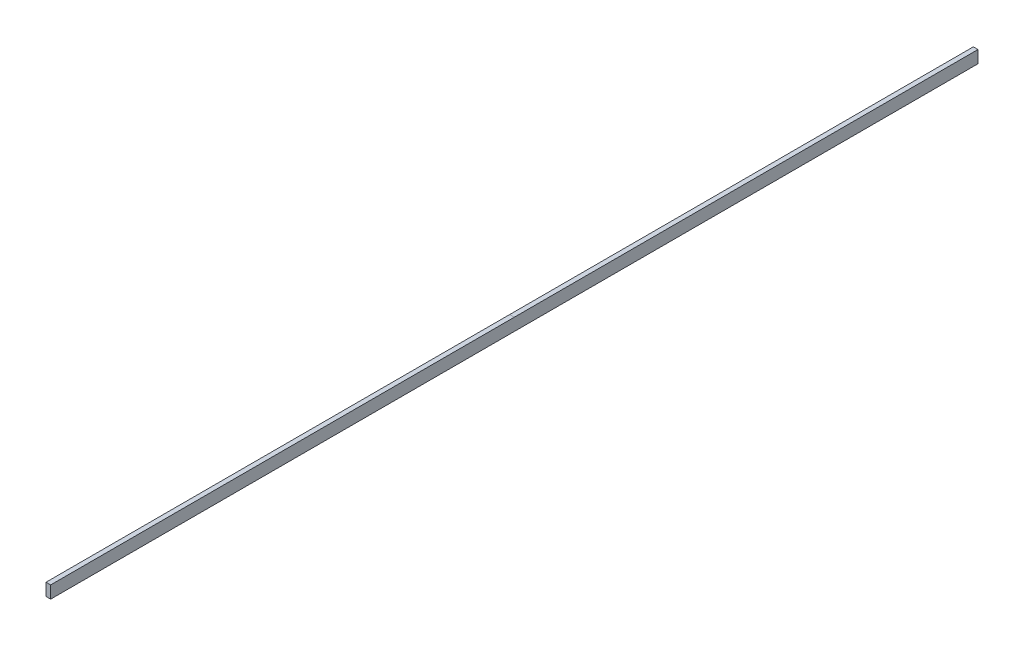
ISO-10303-21;
HEADER;
FILE_DESCRIPTION(('STEP AP214'),'2;1');
FILE_NAME('part.step','',(''),(''),'','','');
FILE_SCHEMA(('AUTOMOTIVE_DESIGN { 1 0 10303 214 1 1 1 1 }'));
ENDSEC;
DATA;
#1=APPLICATION_CONTEXT('core data for automotive mechanical design processes');
#2=APPLICATION_PROTOCOL_DEFINITION('international standard','automotive_design',2000,#1);
#3=PRODUCT_CONTEXT('',#1,'mechanical');
#4=PRODUCT('Part','Part','',(#3));
#5=PRODUCT_RELATED_PRODUCT_CATEGORY('part','',(#4));
#6=PRODUCT_DEFINITION_FORMATION('','',#4);
#7=PRODUCT_DEFINITION_CONTEXT('part definition',#1,'design');
#8=PRODUCT_DEFINITION('design','',#6,#7);
#9=PRODUCT_DEFINITION_SHAPE('','',#8);
#10=(LENGTH_UNIT() NAMED_UNIT(*) SI_UNIT(.MILLI.,.METRE.));
#11=(NAMED_UNIT(*) PLANE_ANGLE_UNIT() SI_UNIT($,.RADIAN.));
#12=(NAMED_UNIT(*) SI_UNIT($,.STERADIAN.) SOLID_ANGLE_UNIT());
#13=UNCERTAINTY_MEASURE_WITH_UNIT(LENGTH_MEASURE(1.E-05),#10,'distance_accuracy_value','');
#14=(GEOMETRIC_REPRESENTATION_CONTEXT(3) GLOBAL_UNCERTAINTY_ASSIGNED_CONTEXT((#13)) GLOBAL_UNIT_ASSIGNED_CONTEXT((#10,
#11,#12)) REPRESENTATION_CONTEXT('',''));
#15=CARTESIAN_POINT('',(0.,0.,0.));
#16=DIRECTION('',(0.,0.,1.));
#17=DIRECTION('',(1.,0.,0.));
#18=AXIS2_PLACEMENT_3D('',#15,#16,#17);
#19=CARTESIAN_POINT('',(-15.,40.,3000.));
#20=DIRECTION('',(0.,-1.,0.));
#21=DIRECTION('',(0.,0.,-1.));
#22=AXIS2_PLACEMENT_3D('',#19,#20,#21);
#23=PLANE('',#22);
#24=DIRECTION('',(1.,0.,0.));
#25=VECTOR('',#24,1.);
#26=CARTESIAN_POINT('',(-15.,40.,3000.));
#27=LINE('',#26,#25);
#28=CARTESIAN_POINT('',(-15.,40.,3000.));
#29=VERTEX_POINT('',#28);
#30=CARTESIAN_POINT('',(15.,40.,3000.));
#31=VERTEX_POINT('',#30);
#32=EDGE_CURVE('E11',#29,#31,#27,.T.);
#33=ORIENTED_EDGE('',*,*,#32,.F.);
#34=DIRECTION('',(0.,0.,-1.));
#35=VECTOR('',#34,1.);
#36=CARTESIAN_POINT('',(-15.,40.,3000.));
#37=LINE('',#36,#35);
#38=CARTESIAN_POINT('',(-15.,40.,6000.));
#39=VERTEX_POINT('',#38);
#40=EDGE_CURVE('E112',#39,#29,#37,.T.);
#41=ORIENTED_EDGE('',*,*,#40,.F.);
#42=DIRECTION('',(-1.,0.,0.));
#43=VECTOR('',#42,1.);
#44=CARTESIAN_POINT('',(-15.,40.,6000.));
#45=LINE('',#44,#43);
#46=CARTESIAN_POINT('',(15.,40.,6000.));
#47=VERTEX_POINT('',#46);
#48=EDGE_CURVE('E97',#47,#39,#45,.T.);
#49=ORIENTED_EDGE('',*,*,#48,.F.);
#50=DIRECTION('',(0.,0.,-1.));
#51=VECTOR('',#50,1.);
#52=CARTESIAN_POINT('',(15.,40.,3000.));
#53=LINE('',#52,#51);
#54=EDGE_CURVE('E115',#47,#31,#53,.T.);
#55=ORIENTED_EDGE('',*,*,#54,.T.);
#56=EDGE_LOOP('',(#33,#41,#49,#55));
#57=FACE_BOUND('',#56,.T.);
#58=ADVANCED_FACE('F32',(#57),#23,.F.);
#59=CARTESIAN_POINT('',(-15.,40.,3000.));
#60=DIRECTION('',(1.,0.,0.));
#61=DIRECTION('',(0.,1.,0.));
#62=AXIS2_PLACEMENT_3D('',#59,#60,#61);
#63=PLANE('',#62);
#64=DIRECTION('',(0.,-1.,0.));
#65=VECTOR('',#64,1.);
#66=CARTESIAN_POINT('',(-15.,40.,0.));
#67=LINE('',#66,#65);
#68=CARTESIAN_POINT('',(-15.,40.,0.));
#69=VERTEX_POINT('',#68);
#70=CARTESIAN_POINT('',(-15.,-40.,0.));
#71=VERTEX_POINT('',#70);
#72=EDGE_CURVE('E82',#69,#71,#67,.T.);
#73=ORIENTED_EDGE('',*,*,#72,.T.);
#74=DIRECTION('',(0.,0.,-1.));
#75=VECTOR('',#74,1.);
#76=CARTESIAN_POINT('',(-15.,-40.,3000.));
#77=LINE('',#76,#75);
#78=CARTESIAN_POINT('',(-15.,-40.,6000.));
#79=VERTEX_POINT('',#78);
#80=EDGE_CURVE('E41',#79,#71,#77,.T.);
#81=ORIENTED_EDGE('',*,*,#80,.F.);
#82=DIRECTION('',(0.,-1.,0.));
#83=VECTOR('',#82,1.);
#84=CARTESIAN_POINT('',(-15.,40.,6000.));
#85=LINE('',#84,#83);
#86=EDGE_CURVE('E80',#39,#79,#85,.T.);
#87=ORIENTED_EDGE('',*,*,#86,.F.);
#88=ORIENTED_EDGE('',*,*,#40,.T.);
#89=EDGE_CURVE('E111',#29,#69,#37,.T.);
#90=ORIENTED_EDGE('',*,*,#89,.T.);
#91=EDGE_LOOP('',(#73,#81,#87,#88,#90));
#92=FACE_BOUND('',#91,.T.);
#93=ADVANCED_FACE('F34',(#92),#63,.F.);
#94=CARTESIAN_POINT('',(-15.,-40.,3000.));
#95=DIRECTION('',(0.,1.,0.));
#96=DIRECTION('',(0.,0.,1.));
#97=AXIS2_PLACEMENT_3D('',#94,#95,#96);
#98=PLANE('',#97);
#99=DIRECTION('',(1.,0.,0.));
#100=VECTOR('',#99,1.);
#101=CARTESIAN_POINT('',(-15.,-40.,0.));
#102=LINE('',#101,#100);
#103=CARTESIAN_POINT('',(15.,-40.,0.));
#104=VERTEX_POINT('',#103);
#105=EDGE_CURVE('E103',#71,#104,#102,.T.);
#106=ORIENTED_EDGE('',*,*,#105,.T.);
#107=DIRECTION('',(0.,0.,-1.));
#108=VECTOR('',#107,1.);
#109=CARTESIAN_POINT('',(15.,-40.,3000.));
#110=LINE('',#109,#108);
#111=CARTESIAN_POINT('',(15.,-40.,6000.));
#112=VERTEX_POINT('',#111);
#113=EDGE_CURVE('E84',#112,#104,#110,.T.);
#114=ORIENTED_EDGE('',*,*,#113,.F.);
#115=DIRECTION('',(1.,0.,0.));
#116=VECTOR('',#115,1.);
#117=CARTESIAN_POINT('',(-15.,-40.,6000.));
#118=LINE('',#117,#116);
#119=EDGE_CURVE('E86',#79,#112,#118,.T.);
#120=ORIENTED_EDGE('',*,*,#119,.F.);
#121=ORIENTED_EDGE('',*,*,#80,.T.);
#122=EDGE_LOOP('',(#106,#114,#120,#121));
#123=FACE_BOUND('',#122,.T.);
#124=ADVANCED_FACE('F87',(#123),#98,.F.);
#125=CARTESIAN_POINT('',(15.,40.,3000.));
#126=DIRECTION('',(-1.,0.,0.));
#127=DIRECTION('',(0.,-1.,0.));
#128=AXIS2_PLACEMENT_3D('',#125,#126,#127);
#129=PLANE('',#128);
#130=DIRECTION('',(0.,1.,0.));
#131=VECTOR('',#130,1.);
#132=CARTESIAN_POINT('',(15.,40.,0.));
#133=LINE('',#132,#131);
#134=CARTESIAN_POINT('',(15.,40.,0.));
#135=VERTEX_POINT('',#134);
#136=EDGE_CURVE('E105',#104,#135,#133,.T.);
#137=ORIENTED_EDGE('',*,*,#136,.T.);
#138=EDGE_CURVE('E114',#31,#135,#53,.T.);
#139=ORIENTED_EDGE('',*,*,#138,.F.);
#140=ORIENTED_EDGE('',*,*,#54,.F.);
#141=DIRECTION('',(0.,1.,0.));
#142=VECTOR('',#141,1.);
#143=CARTESIAN_POINT('',(15.,40.,6000.));
#144=LINE('',#143,#142);
#145=EDGE_CURVE('E92',#112,#47,#144,.T.);
#146=ORIENTED_EDGE('',*,*,#145,.F.);
#147=ORIENTED_EDGE('',*,*,#113,.T.);
#148=EDGE_LOOP('',(#137,#139,#140,#146,#147));
#149=FACE_BOUND('',#148,.T.);
#150=ADVANCED_FACE('F119',(#149),#129,.F.);
#151=ORIENTED_EDGE('',*,*,#89,.F.);
#152=ORIENTED_EDGE('',*,*,#32,.T.);
#153=ORIENTED_EDGE('',*,*,#138,.T.);
#154=DIRECTION('',(-1.,0.,0.));
#155=VECTOR('',#154,1.);
#156=CARTESIAN_POINT('',(-15.,40.,0.));
#157=LINE('',#156,#155);
#158=EDGE_CURVE('E108',#135,#69,#157,.T.);
#159=ORIENTED_EDGE('',*,*,#158,.T.);
#160=EDGE_LOOP('',(#151,#152,#153,#159));
#161=FACE_BOUND('',#160,.T.);
#162=ADVANCED_FACE('F123',(#161),#23,.F.);
#163=CARTESIAN_POINT('',(-15.,-40.,0.));
#164=DIRECTION('',(0.,0.,1.));
#165=DIRECTION('',(1.,0.,0.));
#166=AXIS2_PLACEMENT_3D('',#163,#164,#165);
#167=PLANE('',#166);
#168=ORIENTED_EDGE('',*,*,#72,.F.);
#169=ORIENTED_EDGE('',*,*,#158,.F.);
#170=ORIENTED_EDGE('',*,*,#136,.F.);
#171=ORIENTED_EDGE('',*,*,#105,.F.);
#172=EDGE_LOOP('',(#168,#169,#170,#171));
#173=FACE_BOUND('',#172,.T.);
#174=ADVANCED_FACE('F122',(#173),#167,.F.);
#175=CARTESIAN_POINT('',(-15.,-40.,6000.));
#176=DIRECTION('',(0.,0.,1.));
#177=DIRECTION('',(1.,0.,0.));
#178=AXIS2_PLACEMENT_3D('',#175,#176,#177);
#179=PLANE('',#178);
#180=ORIENTED_EDGE('',*,*,#86,.T.);
#181=ORIENTED_EDGE('',*,*,#119,.T.);
#182=ORIENTED_EDGE('',*,*,#145,.T.);
#183=ORIENTED_EDGE('',*,*,#48,.T.);
#184=EDGE_LOOP('',(#180,#181,#182,#183));
#185=FACE_BOUND('',#184,.T.);
#186=ADVANCED_FACE('F95',(#185),#179,.T.);
#187=CLOSED_SHELL('',(#58,#93,#124,#150,#162,#174,#186));
#188=MANIFOLD_SOLID_BREP('B2',#187);
#189=ADVANCED_BREP_SHAPE_REPRESENTATION('',(#18,#188),#14);
#190=SHAPE_DEFINITION_REPRESENTATION(#9,#189);
ENDSEC;
END-ISO-10303-21;
